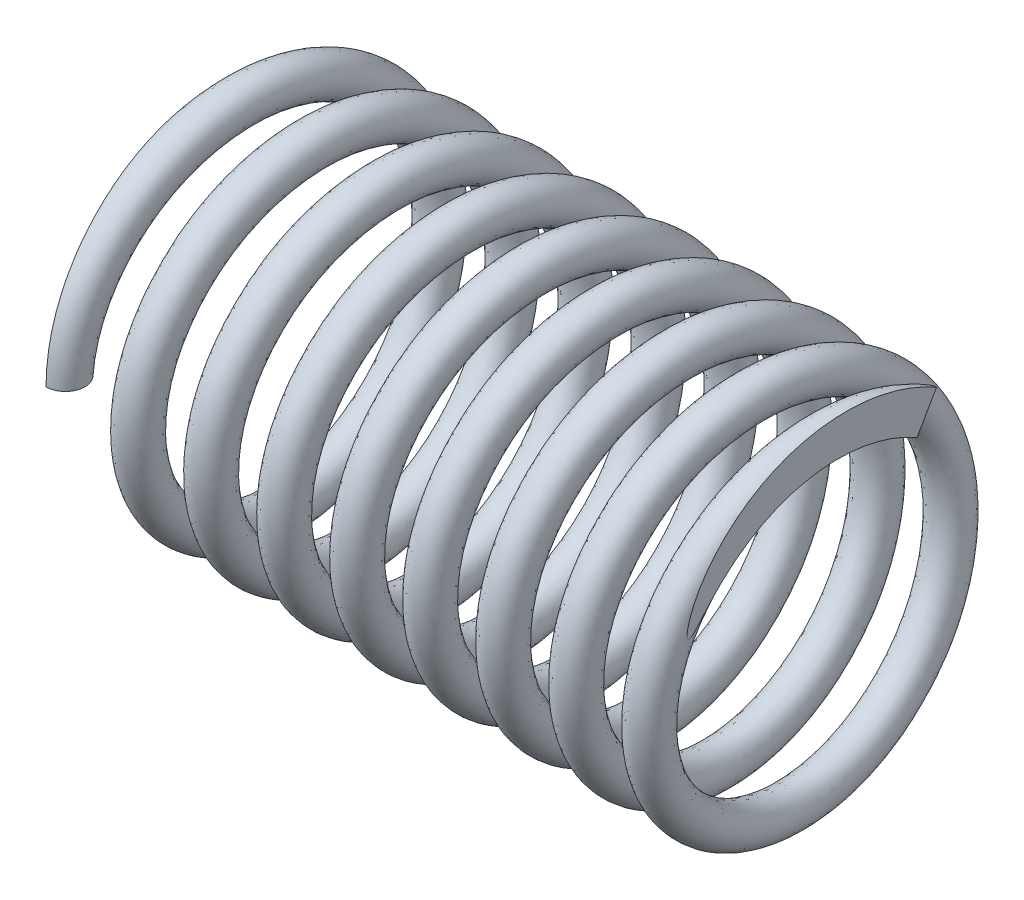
from build123d import *

# Parameters (mm, degrees)
SWEEP1_PITCH       = 1.524
SWEEP1_HEIGHT      = 12.7
SWEEP1_RADIUS      = 3.5179
SKETCH2_R          = 0.4064
SKETCH3_R          = 4.124179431
CUT_EXTRUDE1_DEPTH = 0.508
CUT_EXTRUDE2_START = 12.7
SKETCH3_2_R        = 4.124179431
CUT_EXTRUDE2_DEPTH = 0.508


with BuildPart() as part:
    # Sweep1: sweep along a helix
    with BuildLine() as sweep1_path:
        Helix(SWEEP1_PITCH, SWEEP1_HEIGHT, SWEEP1_RADIUS, center=(0, 0, 0), direction=(1, 0, 0), lefthand=True)
    # Sketch2 → Sweep1 (sweep)
    with BuildSketch(Plane(origin=(0, 0, 0), x_dir=(1, 0, 0), z_dir=(0, 1, 0))):
        with Locations((0, -3.5179)):
            Circle(SKETCH2_R)
    sweep(path=sweep1_path.line, is_frenet=True)

    # Sketch3 → Cut-Extrude1 (cut)
    with BuildSketch(Plane(origin=(0, 0, 0), x_dir=(0, 0, -1), z_dir=(1, 0, 0))):
        Circle(SKETCH3_R)
    extrude(amount=-CUT_EXTRUDE1_DEPTH, mode=Mode.SUBTRACT)

    # Sketch3_2 → Cut-Extrude2 (cut)
    with BuildSketch(Plane(origin=(0, 0, 0), x_dir=(0, 0, -1), z_dir=(1, 0, 0)).offset(CUT_EXTRUDE2_START)):
        Circle(SKETCH3_2_R)
    extrude(amount=CUT_EXTRUDE2_DEPTH, mode=Mode.SUBTRACT)


solid = part.part
